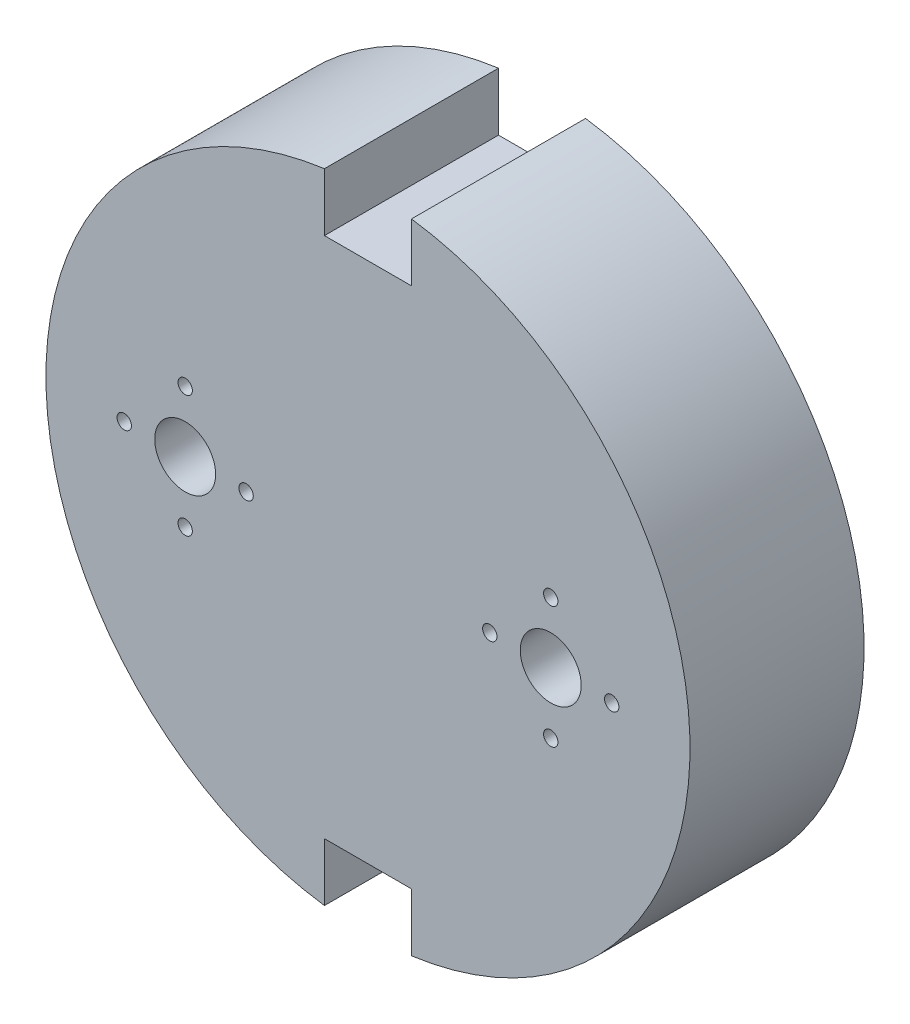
ISO-10303-21;
HEADER;
FILE_DESCRIPTION(('STEP AP214'),'2;1');
FILE_NAME('part.step','',(''),(''),'','','');
FILE_SCHEMA(('AUTOMOTIVE_DESIGN { 1 0 10303 214 1 1 1 1 }'));
ENDSEC;
DATA;
#1=APPLICATION_CONTEXT('core data for automotive mechanical design processes');
#2=APPLICATION_PROTOCOL_DEFINITION('international standard','automotive_design',2000,#1);
#3=PRODUCT_CONTEXT('',#1,'mechanical');
#4=PRODUCT('Part','Part','',(#3));
#5=PRODUCT_RELATED_PRODUCT_CATEGORY('part','',(#4));
#6=PRODUCT_DEFINITION_FORMATION('','',#4);
#7=PRODUCT_DEFINITION_CONTEXT('part definition',#1,'design');
#8=PRODUCT_DEFINITION('design','',#6,#7);
#9=PRODUCT_DEFINITION_SHAPE('','',#8);
#10=(LENGTH_UNIT() NAMED_UNIT(*) SI_UNIT(.MILLI.,.METRE.));
#11=(NAMED_UNIT(*) PLANE_ANGLE_UNIT() SI_UNIT($,.RADIAN.));
#12=(NAMED_UNIT(*) SI_UNIT($,.STERADIAN.) SOLID_ANGLE_UNIT());
#13=UNCERTAINTY_MEASURE_WITH_UNIT(LENGTH_MEASURE(1.E-05),#10,'distance_accuracy_value','');
#14=(GEOMETRIC_REPRESENTATION_CONTEXT(3) GLOBAL_UNCERTAINTY_ASSIGNED_CONTEXT((#13)) GLOBAL_UNIT_ASSIGNED_CONTEXT((#10,
#11,#12)) REPRESENTATION_CONTEXT('',''));
#15=CARTESIAN_POINT('',(0.,0.,0.));
#16=DIRECTION('',(0.,0.,1.));
#17=DIRECTION('',(1.,0.,0.));
#18=AXIS2_PLACEMENT_3D('',#15,#16,#17);
#19=CARTESIAN_POINT('',(0.,0.,0.));
#20=DIRECTION('',(0.,0.,1.));
#21=DIRECTION('',(1.,0.,0.));
#22=AXIS2_PLACEMENT_3D('',#19,#20,#21);
#23=PLANE('',#22);
#24=CARTESIAN_POINT('',(-42.,14.,0.));
#25=DIRECTION('',(0.,0.,1.));
#26=DIRECTION('',(1.,0.,0.));
#27=AXIS2_PLACEMENT_3D('',#24,#25,#26);
#28=CIRCLE('',#27,1.64999999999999);
#29=CARTESIAN_POINT('',(-40.35,14.,0.));
#30=VERTEX_POINT('',#29);
#31=EDGE_CURVE('E290',#30,#30,#28,.T.);
#32=ORIENTED_EDGE('',*,*,#31,.T.);
#33=EDGE_LOOP('',(#32));
#34=FACE_BOUND('',#33,.T.);
#35=CARTESIAN_POINT('',(-42.,-14.,0.));
#36=DIRECTION('',(0.,0.,1.));
#37=DIRECTION('',(1.,0.,0.));
#38=AXIS2_PLACEMENT_3D('',#35,#36,#37);
#39=CIRCLE('',#38,1.64999999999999);
#40=CARTESIAN_POINT('',(-40.35,-14.,0.));
#41=VERTEX_POINT('',#40);
#42=EDGE_CURVE('E284',#41,#41,#39,.T.);
#43=ORIENTED_EDGE('',*,*,#42,.T.);
#44=EDGE_LOOP('',(#43));
#45=FACE_BOUND('',#44,.T.);
#46=CARTESIAN_POINT('',(-28.,0.,0.));
#47=DIRECTION('',(0.,0.,1.));
#48=DIRECTION('',(1.,0.,0.));
#49=AXIS2_PLACEMENT_3D('',#46,#47,#48);
#50=CIRCLE('',#49,1.64999999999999);
#51=CARTESIAN_POINT('',(-26.35,0.,0.));
#52=VERTEX_POINT('',#51);
#53=EDGE_CURVE('E278',#52,#52,#50,.T.);
#54=ORIENTED_EDGE('',*,*,#53,.T.);
#55=EDGE_LOOP('',(#54));
#56=FACE_BOUND('',#55,.T.);
#57=CARTESIAN_POINT('',(28.,0.,0.));
#58=DIRECTION('',(0.,0.,1.));
#59=DIRECTION('',(1.,0.,0.));
#60=AXIS2_PLACEMENT_3D('',#57,#58,#59);
#61=CIRCLE('',#60,1.64999999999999);
#62=CARTESIAN_POINT('',(29.65,0.,0.));
#63=VERTEX_POINT('',#62);
#64=EDGE_CURVE('E272',#63,#63,#61,.T.);
#65=ORIENTED_EDGE('',*,*,#64,.T.);
#66=EDGE_LOOP('',(#65));
#67=FACE_BOUND('',#66,.T.);
#68=CARTESIAN_POINT('',(42.,14.,0.));
#69=DIRECTION('',(0.,0.,1.));
#70=DIRECTION('',(1.,0.,0.));
#71=AXIS2_PLACEMENT_3D('',#68,#69,#70);
#72=CIRCLE('',#71,1.64999999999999);
#73=CARTESIAN_POINT('',(43.65,14.,0.));
#74=VERTEX_POINT('',#73);
#75=EDGE_CURVE('E266',#74,#74,#72,.T.);
#76=ORIENTED_EDGE('',*,*,#75,.T.);
#77=EDGE_LOOP('',(#76));
#78=FACE_BOUND('',#77,.T.);
#79=CARTESIAN_POINT('',(56.,0.,0.));
#80=DIRECTION('',(0.,0.,1.));
#81=DIRECTION('',(1.,0.,0.));
#82=AXIS2_PLACEMENT_3D('',#79,#80,#81);
#83=CIRCLE('',#82,1.64999999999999);
#84=CARTESIAN_POINT('',(57.65,0.,0.));
#85=VERTEX_POINT('',#84);
#86=EDGE_CURVE('E260',#85,#85,#83,.T.);
#87=ORIENTED_EDGE('',*,*,#86,.T.);
#88=EDGE_LOOP('',(#87));
#89=FACE_BOUND('',#88,.T.);
#90=CARTESIAN_POINT('',(42.,-14.,0.));
#91=DIRECTION('',(0.,0.,1.));
#92=DIRECTION('',(1.,0.,0.));
#93=AXIS2_PLACEMENT_3D('',#90,#91,#92);
#94=CIRCLE('',#93,1.64999999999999);
#95=CARTESIAN_POINT('',(43.65,-14.,0.));
#96=VERTEX_POINT('',#95);
#97=EDGE_CURVE('E254',#96,#96,#94,.T.);
#98=ORIENTED_EDGE('',*,*,#97,.T.);
#99=EDGE_LOOP('',(#98));
#100=FACE_BOUND('',#99,.T.);
#101=CARTESIAN_POINT('',(-56.,0.,0.));
#102=DIRECTION('',(0.,0.,1.));
#103=DIRECTION('',(1.,0.,0.));
#104=AXIS2_PLACEMENT_3D('',#101,#102,#103);
#105=CIRCLE('',#104,1.64999999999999);
#106=CARTESIAN_POINT('',(-54.35,0.,0.));
#107=VERTEX_POINT('',#106);
#108=EDGE_CURVE('E246',#107,#107,#105,.T.);
#109=ORIENTED_EDGE('',*,*,#108,.T.);
#110=EDGE_LOOP('',(#109));
#111=FACE_BOUND('',#110,.T.);
#112=CARTESIAN_POINT('',(42.,0.,0.));
#113=DIRECTION('',(0.,0.,1.));
#114=DIRECTION('',(1.,0.,0.));
#115=AXIS2_PLACEMENT_3D('',#112,#113,#114);
#116=CIRCLE('',#115,7.);
#117=CARTESIAN_POINT('',(49.,0.,0.));
#118=VERTEX_POINT('',#117);
#119=EDGE_CURVE('E243',#118,#118,#116,.T.);
#120=ORIENTED_EDGE('',*,*,#119,.T.);
#121=EDGE_LOOP('',(#120));
#122=FACE_BOUND('',#121,.T.);
#123=CARTESIAN_POINT('',(0.,0.,0.));
#124=DIRECTION('',(0.,0.,1.));
#125=DIRECTION('',(1.,0.,0.));
#126=AXIS2_PLACEMENT_3D('',#123,#124,#125);
#127=CIRCLE('',#126,74.);
#128=CARTESIAN_POINT('',(10.,-73.3212111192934,0.));
#129=VERTEX_POINT('',#128);
#130=CARTESIAN_POINT('',(9.99999999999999,73.3212111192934,0.));
#131=VERTEX_POINT('',#130);
#132=EDGE_CURVE('E131',#129,#131,#127,.T.);
#133=ORIENTED_EDGE('',*,*,#132,.F.);
#134=DIRECTION('',(0.,-1.,0.));
#135=VECTOR('',#134,1.);
#136=CARTESIAN_POINT('',(10.,-60.,0.));
#137=LINE('',#136,#135);
#138=CARTESIAN_POINT('',(10.,-60.,0.));
#139=VERTEX_POINT('',#138);
#140=EDGE_CURVE('E84',#139,#129,#137,.T.);
#141=ORIENTED_EDGE('',*,*,#140,.F.);
#142=DIRECTION('',(1.,0.,0.));
#143=VECTOR('',#142,1.);
#144=CARTESIAN_POINT('',(-9.99999999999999,-60.,0.));
#145=LINE('',#144,#143);
#146=CARTESIAN_POINT('',(-9.99999999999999,-60.,0.));
#147=VERTEX_POINT('',#146);
#148=EDGE_CURVE('E78',#147,#139,#145,.T.);
#149=ORIENTED_EDGE('',*,*,#148,.F.);
#150=DIRECTION('',(0.,1.,0.));
#151=VECTOR('',#150,1.);
#152=CARTESIAN_POINT('',(-9.99999999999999,-60.,0.));
#153=LINE('',#152,#151);
#154=CARTESIAN_POINT('',(-10.,-73.3212111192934,0.));
#155=VERTEX_POINT('',#154);
#156=EDGE_CURVE('E121',#155,#147,#153,.T.);
#157=ORIENTED_EDGE('',*,*,#156,.F.);
#158=CARTESIAN_POINT('',(0.,0.,0.));
#159=DIRECTION('',(0.,0.,1.));
#160=DIRECTION('',(1.,0.,0.));
#161=AXIS2_PLACEMENT_3D('',#158,#159,#160);
#162=CIRCLE('',#161,74.);
#163=CARTESIAN_POINT('',(-10.,73.3212111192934,0.));
#164=VERTEX_POINT('',#163);
#165=EDGE_CURVE('E141',#164,#155,#162,.T.);
#166=ORIENTED_EDGE('',*,*,#165,.F.);
#167=DIRECTION('',(0.,1.,0.));
#168=VECTOR('',#167,1.);
#169=CARTESIAN_POINT('',(-10.,73.3212111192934,0.));
#170=LINE('',#169,#168);
#171=CARTESIAN_POINT('',(-10.,60.,0.));
#172=VERTEX_POINT('',#171);
#173=EDGE_CURVE('E139',#172,#164,#170,.T.);
#174=ORIENTED_EDGE('',*,*,#173,.F.);
#175=DIRECTION('',(-1.,0.,0.));
#176=VECTOR('',#175,1.);
#177=CARTESIAN_POINT('',(-10.,60.,0.));
#178=LINE('',#177,#176);
#179=CARTESIAN_POINT('',(9.99999999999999,60.,0.));
#180=VERTEX_POINT('',#179);
#181=EDGE_CURVE('E137',#180,#172,#178,.T.);
#182=ORIENTED_EDGE('',*,*,#181,.F.);
#183=DIRECTION('',(0.,-1.,0.));
#184=VECTOR('',#183,1.);
#185=CARTESIAN_POINT('',(9.99999999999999,73.3212111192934,0.));
#186=LINE('',#185,#184);
#187=EDGE_CURVE('E134',#131,#180,#186,.T.);
#188=ORIENTED_EDGE('',*,*,#187,.F.);
#189=EDGE_LOOP('',(#133,#141,#149,#157,#166,#174,#182,#188));
#190=FACE_BOUND('',#189,.T.);
#191=CARTESIAN_POINT('',(-42.,0.,0.));
#192=DIRECTION('',(0.,0.,1.));
#193=DIRECTION('',(1.,0.,0.));
#194=AXIS2_PLACEMENT_3D('',#191,#192,#193);
#195=CIRCLE('',#194,7.);
#196=CARTESIAN_POINT('',(-35.,0.,0.));
#197=VERTEX_POINT('',#196);
#198=EDGE_CURVE('E237',#197,#197,#195,.T.);
#199=ORIENTED_EDGE('',*,*,#198,.T.);
#200=EDGE_LOOP('',(#199));
#201=FACE_BOUND('',#200,.T.);
#202=CARTESIAN_POINT('',(0.,0.,0.));
#203=DIRECTION('',(0.,0.,1.));
#204=DIRECTION('',(1.,0.,0.));
#205=AXIS2_PLACEMENT_3D('',#202,#203,#204);
#206=CIRCLE('',#205,15.);
#207=CARTESIAN_POINT('',(15.,0.,0.));
#208=VERTEX_POINT('',#207);
#209=EDGE_CURVE('E161',#208,#208,#206,.F.);
#210=ORIENTED_EDGE('',*,*,#209,.F.);
#211=EDGE_LOOP('',(#210));
#212=FACE_BOUND('',#211,.T.);
#213=ADVANCED_FACE('F32',(#34,#45,#56,#67,#78,#89,#100,#111,#122,#190,#201,#212),#23,.F.);
#214=CARTESIAN_POINT('',(0.,0.,40.));
#215=DIRECTION('',(0.,0.,1.));
#216=DIRECTION('',(1.,0.,0.));
#217=AXIS2_PLACEMENT_3D('',#214,#215,#216);
#218=PLANE('',#217);
#219=CARTESIAN_POINT('',(-42.,14.,40.));
#220=DIRECTION('',(0.,0.,1.));
#221=DIRECTION('',(1.,0.,0.));
#222=AXIS2_PLACEMENT_3D('',#219,#220,#221);
#223=CIRCLE('',#222,1.65);
#224=CARTESIAN_POINT('',(-40.35,14.,40.));
#225=VERTEX_POINT('',#224);
#226=EDGE_CURVE('E292',#225,#225,#223,.T.);
#227=ORIENTED_EDGE('',*,*,#226,.F.);
#228=EDGE_LOOP('',(#227));
#229=FACE_BOUND('',#228,.T.);
#230=CARTESIAN_POINT('',(-42.,-14.,40.));
#231=DIRECTION('',(0.,0.,1.));
#232=DIRECTION('',(1.,0.,0.));
#233=AXIS2_PLACEMENT_3D('',#230,#231,#232);
#234=CIRCLE('',#233,1.65);
#235=CARTESIAN_POINT('',(-40.35,-14.,40.));
#236=VERTEX_POINT('',#235);
#237=EDGE_CURVE('E287',#236,#236,#234,.T.);
#238=ORIENTED_EDGE('',*,*,#237,.F.);
#239=EDGE_LOOP('',(#238));
#240=FACE_BOUND('',#239,.T.);
#241=CARTESIAN_POINT('',(-28.,0.,40.));
#242=DIRECTION('',(0.,0.,1.));
#243=DIRECTION('',(1.,0.,0.));
#244=AXIS2_PLACEMENT_3D('',#241,#242,#243);
#245=CIRCLE('',#244,1.65);
#246=CARTESIAN_POINT('',(-26.35,0.,40.));
#247=VERTEX_POINT('',#246);
#248=EDGE_CURVE('E281',#247,#247,#245,.T.);
#249=ORIENTED_EDGE('',*,*,#248,.F.);
#250=EDGE_LOOP('',(#249));
#251=FACE_BOUND('',#250,.T.);
#252=CARTESIAN_POINT('',(28.,0.,40.));
#253=DIRECTION('',(0.,0.,1.));
#254=DIRECTION('',(1.,0.,0.));
#255=AXIS2_PLACEMENT_3D('',#252,#253,#254);
#256=CIRCLE('',#255,1.65);
#257=CARTESIAN_POINT('',(29.65,0.,40.));
#258=VERTEX_POINT('',#257);
#259=EDGE_CURVE('E275',#258,#258,#256,.T.);
#260=ORIENTED_EDGE('',*,*,#259,.F.);
#261=EDGE_LOOP('',(#260));
#262=FACE_BOUND('',#261,.T.);
#263=CARTESIAN_POINT('',(42.,14.,40.));
#264=DIRECTION('',(0.,0.,1.));
#265=DIRECTION('',(1.,0.,0.));
#266=AXIS2_PLACEMENT_3D('',#263,#264,#265);
#267=CIRCLE('',#266,1.65);
#268=CARTESIAN_POINT('',(43.65,14.,40.));
#269=VERTEX_POINT('',#268);
#270=EDGE_CURVE('E269',#269,#269,#267,.T.);
#271=ORIENTED_EDGE('',*,*,#270,.F.);
#272=EDGE_LOOP('',(#271));
#273=FACE_BOUND('',#272,.T.);
#274=CARTESIAN_POINT('',(56.,0.,40.));
#275=DIRECTION('',(0.,0.,1.));
#276=DIRECTION('',(1.,0.,0.));
#277=AXIS2_PLACEMENT_3D('',#274,#275,#276);
#278=CIRCLE('',#277,1.65);
#279=CARTESIAN_POINT('',(57.65,0.,40.));
#280=VERTEX_POINT('',#279);
#281=EDGE_CURVE('E263',#280,#280,#278,.T.);
#282=ORIENTED_EDGE('',*,*,#281,.F.);
#283=EDGE_LOOP('',(#282));
#284=FACE_BOUND('',#283,.T.);
#285=CARTESIAN_POINT('',(42.,-14.,40.));
#286=DIRECTION('',(0.,0.,1.));
#287=DIRECTION('',(1.,0.,0.));
#288=AXIS2_PLACEMENT_3D('',#285,#286,#287);
#289=CIRCLE('',#288,1.65);
#290=CARTESIAN_POINT('',(43.65,-14.,40.));
#291=VERTEX_POINT('',#290);
#292=EDGE_CURVE('E257',#291,#291,#289,.T.);
#293=ORIENTED_EDGE('',*,*,#292,.F.);
#294=EDGE_LOOP('',(#293));
#295=FACE_BOUND('',#294,.T.);
#296=CARTESIAN_POINT('',(-56.,0.,40.));
#297=DIRECTION('',(0.,0.,1.));
#298=DIRECTION('',(1.,0.,0.));
#299=AXIS2_PLACEMENT_3D('',#296,#297,#298);
#300=CIRCLE('',#299,1.65);
#301=CARTESIAN_POINT('',(-54.35,0.,40.));
#302=VERTEX_POINT('',#301);
#303=EDGE_CURVE('E251',#302,#302,#300,.T.);
#304=ORIENTED_EDGE('',*,*,#303,.F.);
#305=EDGE_LOOP('',(#304));
#306=FACE_BOUND('',#305,.T.);
#307=CARTESIAN_POINT('',(-42.,0.,40.));
#308=DIRECTION('',(0.,0.,1.));
#309=DIRECTION('',(1.,0.,0.));
#310=AXIS2_PLACEMENT_3D('',#307,#308,#309);
#311=CIRCLE('',#310,7.);
#312=CARTESIAN_POINT('',(-35.,0.,40.));
#313=VERTEX_POINT('',#312);
#314=EDGE_CURVE('E135',#313,#313,#311,.T.);
#315=ORIENTED_EDGE('',*,*,#314,.F.);
#316=EDGE_LOOP('',(#315));
#317=FACE_BOUND('',#316,.T.);
#318=CARTESIAN_POINT('',(0.,0.,40.));
#319=DIRECTION('',(0.,0.,1.));
#320=DIRECTION('',(1.,0.,0.));
#321=AXIS2_PLACEMENT_3D('',#318,#319,#320);
#322=CIRCLE('',#321,74.);
#323=CARTESIAN_POINT('',(10.,-73.3212111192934,40.));
#324=VERTEX_POINT('',#323);
#325=CARTESIAN_POINT('',(9.99999999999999,73.3212111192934,40.));
#326=VERTEX_POINT('',#325);
#327=EDGE_CURVE('E146',#324,#326,#322,.T.);
#328=ORIENTED_EDGE('',*,*,#327,.T.);
#329=DIRECTION('',(0.,-1.,0.));
#330=VECTOR('',#329,1.);
#331=CARTESIAN_POINT('',(9.99999999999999,73.3212111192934,40.));
#332=LINE('',#331,#330);
#333=CARTESIAN_POINT('',(9.99999999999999,60.,40.));
#334=VERTEX_POINT('',#333);
#335=EDGE_CURVE('E93',#326,#334,#332,.T.);
#336=ORIENTED_EDGE('',*,*,#335,.T.);
#337=DIRECTION('',(-1.,0.,0.));
#338=VECTOR('',#337,1.);
#339=CARTESIAN_POINT('',(-10.,60.,40.));
#340=LINE('',#339,#338);
#341=CARTESIAN_POINT('',(-10.,60.,40.));
#342=VERTEX_POINT('',#341);
#343=EDGE_CURVE('E229',#334,#342,#340,.T.);
#344=ORIENTED_EDGE('',*,*,#343,.T.);
#345=DIRECTION('',(0.,1.,0.));
#346=VECTOR('',#345,1.);
#347=CARTESIAN_POINT('',(-10.,73.3212111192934,40.));
#348=LINE('',#347,#346);
#349=CARTESIAN_POINT('',(-10.,73.3212111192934,40.));
#350=VERTEX_POINT('',#349);
#351=EDGE_CURVE('E231',#342,#350,#348,.T.);
#352=ORIENTED_EDGE('',*,*,#351,.T.);
#353=CARTESIAN_POINT('',(0.,0.,40.));
#354=DIRECTION('',(0.,0.,1.));
#355=DIRECTION('',(1.,0.,0.));
#356=AXIS2_PLACEMENT_3D('',#353,#354,#355);
#357=CIRCLE('',#356,74.);
#358=CARTESIAN_POINT('',(-10.,-73.3212111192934,40.));
#359=VERTEX_POINT('',#358);
#360=EDGE_CURVE('E113',#350,#359,#357,.T.);
#361=ORIENTED_EDGE('',*,*,#360,.T.);
#362=DIRECTION('',(0.,1.,0.));
#363=VECTOR('',#362,1.);
#364=CARTESIAN_POINT('',(-9.99999999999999,-60.,40.));
#365=LINE('',#364,#363);
#366=CARTESIAN_POINT('',(-9.99999999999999,-60.,40.));
#367=VERTEX_POINT('',#366);
#368=EDGE_CURVE('E106',#359,#367,#365,.T.);
#369=ORIENTED_EDGE('',*,*,#368,.T.);
#370=DIRECTION('',(1.,0.,0.));
#371=VECTOR('',#370,1.);
#372=CARTESIAN_POINT('',(-9.99999999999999,-60.,40.));
#373=LINE('',#372,#371);
#374=CARTESIAN_POINT('',(10.,-60.,40.));
#375=VERTEX_POINT('',#374);
#376=EDGE_CURVE('E111',#367,#375,#373,.T.);
#377=ORIENTED_EDGE('',*,*,#376,.T.);
#378=DIRECTION('',(0.,-1.,0.));
#379=VECTOR('',#378,1.);
#380=CARTESIAN_POINT('',(10.,-60.,40.));
#381=LINE('',#380,#379);
#382=EDGE_CURVE('E49',#375,#324,#381,.T.);
#383=ORIENTED_EDGE('',*,*,#382,.T.);
#384=EDGE_LOOP('',(#328,#336,#344,#352,#361,#369,#377,#383));
#385=FACE_BOUND('',#384,.T.);
#386=CARTESIAN_POINT('',(42.,0.,40.));
#387=DIRECTION('',(0.,0.,1.));
#388=DIRECTION('',(1.,0.,0.));
#389=AXIS2_PLACEMENT_3D('',#386,#387,#388);
#390=CIRCLE('',#389,7.);
#391=CARTESIAN_POINT('',(49.,0.,40.));
#392=VERTEX_POINT('',#391);
#393=EDGE_CURVE('E240',#392,#392,#390,.T.);
#394=ORIENTED_EDGE('',*,*,#393,.F.);
#395=EDGE_LOOP('',(#394));
#396=FACE_BOUND('',#395,.T.);
#397=ADVANCED_FACE('F108',(#229,#240,#251,#262,#273,#284,#295,#306,#317,#385,#396),#218,.T.);
#398=CARTESIAN_POINT('',(0.,0.,40.));
#399=DIRECTION('',(0.,0.,-1.));
#400=DIRECTION('',(-1.,0.,0.));
#401=AXIS2_PLACEMENT_3D('',#398,#399,#400);
#402=CYLINDRICAL_SURFACE('',#401,74.);
#403=ORIENTED_EDGE('',*,*,#132,.T.);
#404=DIRECTION('',(0.,0.,-1.));
#405=VECTOR('',#404,1.);
#406=CARTESIAN_POINT('',(9.99999999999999,73.3212111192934,40.));
#407=LINE('',#406,#405);
#408=EDGE_CURVE('E159',#326,#131,#407,.T.);
#409=ORIENTED_EDGE('',*,*,#408,.F.);
#410=ORIENTED_EDGE('',*,*,#327,.F.);
#411=DIRECTION('',(0.,0.,-1.));
#412=VECTOR('',#411,1.);
#413=CARTESIAN_POINT('',(10.,-73.3212111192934,40.));
#414=LINE('',#413,#412);
#415=EDGE_CURVE('E127',#324,#129,#414,.T.);
#416=ORIENTED_EDGE('',*,*,#415,.T.);
#417=EDGE_LOOP('',(#403,#409,#410,#416));
#418=FACE_BOUND('',#417,.T.);
#419=ADVANCED_FACE('F187',(#418),#402,.T.);
#420=CARTESIAN_POINT('',(9.99999999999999,73.3212111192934,40.));
#421=DIRECTION('',(1.,0.,0.));
#422=DIRECTION('',(0.,1.,0.));
#423=AXIS2_PLACEMENT_3D('',#420,#421,#422);
#424=PLANE('',#423);
#425=ORIENTED_EDGE('',*,*,#187,.T.);
#426=DIRECTION('',(0.,0.,-1.));
#427=VECTOR('',#426,1.);
#428=CARTESIAN_POINT('',(9.99999999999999,60.,40.));
#429=LINE('',#428,#427);
#430=EDGE_CURVE('E156',#334,#180,#429,.T.);
#431=ORIENTED_EDGE('',*,*,#430,.F.);
#432=ORIENTED_EDGE('',*,*,#335,.F.);
#433=ORIENTED_EDGE('',*,*,#408,.T.);
#434=EDGE_LOOP('',(#425,#431,#432,#433));
#435=FACE_BOUND('',#434,.T.);
#436=ADVANCED_FACE('F213',(#435),#424,.F.);
#437=CARTESIAN_POINT('',(-10.,60.,40.));
#438=DIRECTION('',(0.,-1.,0.));
#439=DIRECTION('',(0.,0.,-1.));
#440=AXIS2_PLACEMENT_3D('',#437,#438,#439);
#441=PLANE('',#440);
#442=ORIENTED_EDGE('',*,*,#181,.T.);
#443=DIRECTION('',(0.,0.,-1.));
#444=VECTOR('',#443,1.);
#445=CARTESIAN_POINT('',(-10.,60.,40.));
#446=LINE('',#445,#444);
#447=EDGE_CURVE('E153',#342,#172,#446,.T.);
#448=ORIENTED_EDGE('',*,*,#447,.F.);
#449=ORIENTED_EDGE('',*,*,#343,.F.);
#450=ORIENTED_EDGE('',*,*,#430,.T.);
#451=EDGE_LOOP('',(#442,#448,#449,#450));
#452=FACE_BOUND('',#451,.T.);
#453=ADVANCED_FACE('F209',(#452),#441,.F.);
#454=CARTESIAN_POINT('',(-10.,73.3212111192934,40.));
#455=DIRECTION('',(-1.,0.,0.));
#456=DIRECTION('',(0.,-1.,0.));
#457=AXIS2_PLACEMENT_3D('',#454,#455,#456);
#458=PLANE('',#457);
#459=ORIENTED_EDGE('',*,*,#173,.T.);
#460=DIRECTION('',(0.,0.,-1.));
#461=VECTOR('',#460,1.);
#462=CARTESIAN_POINT('',(-10.,73.3212111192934,40.));
#463=LINE('',#462,#461);
#464=EDGE_CURVE('E150',#350,#164,#463,.T.);
#465=ORIENTED_EDGE('',*,*,#464,.F.);
#466=ORIENTED_EDGE('',*,*,#351,.F.);
#467=ORIENTED_EDGE('',*,*,#447,.T.);
#468=EDGE_LOOP('',(#459,#465,#466,#467));
#469=FACE_BOUND('',#468,.T.);
#470=ADVANCED_FACE('F205',(#469),#458,.F.);
#471=CARTESIAN_POINT('',(0.,0.,40.));
#472=DIRECTION('',(0.,0.,-1.));
#473=DIRECTION('',(-1.,0.,0.));
#474=AXIS2_PLACEMENT_3D('',#471,#472,#473);
#475=CYLINDRICAL_SURFACE('',#474,74.);
#476=ORIENTED_EDGE('',*,*,#165,.T.);
#477=DIRECTION('',(0.,0.,-1.));
#478=VECTOR('',#477,1.);
#479=CARTESIAN_POINT('',(-10.,-73.3212111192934,40.));
#480=LINE('',#479,#478);
#481=EDGE_CURVE('E122',#359,#155,#480,.T.);
#482=ORIENTED_EDGE('',*,*,#481,.F.);
#483=ORIENTED_EDGE('',*,*,#360,.F.);
#484=ORIENTED_EDGE('',*,*,#464,.T.);
#485=EDGE_LOOP('',(#476,#482,#483,#484));
#486=FACE_BOUND('',#485,.T.);
#487=ADVANCED_FACE('F202',(#486),#475,.T.);
#488=CARTESIAN_POINT('',(-9.99999999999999,-60.,40.));
#489=DIRECTION('',(-1.,0.,0.));
#490=DIRECTION('',(0.,-1.,0.));
#491=AXIS2_PLACEMENT_3D('',#488,#489,#490);
#492=PLANE('',#491);
#493=ORIENTED_EDGE('',*,*,#156,.T.);
#494=DIRECTION('',(0.,0.,-1.));
#495=VECTOR('',#494,1.);
#496=CARTESIAN_POINT('',(-9.99999999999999,-60.,40.));
#497=LINE('',#496,#495);
#498=EDGE_CURVE('E118',#367,#147,#497,.T.);
#499=ORIENTED_EDGE('',*,*,#498,.F.);
#500=ORIENTED_EDGE('',*,*,#368,.F.);
#501=ORIENTED_EDGE('',*,*,#481,.T.);
#502=EDGE_LOOP('',(#493,#499,#500,#501));
#503=FACE_BOUND('',#502,.T.);
#504=ADVANCED_FACE('F119',(#503),#492,.F.);
#505=CARTESIAN_POINT('',(-9.99999999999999,-60.,40.));
#506=DIRECTION('',(0.,1.,0.));
#507=DIRECTION('',(0.,0.,1.));
#508=AXIS2_PLACEMENT_3D('',#505,#506,#507);
#509=PLANE('',#508);
#510=ORIENTED_EDGE('',*,*,#148,.T.);
#511=DIRECTION('',(0.,0.,-1.));
#512=VECTOR('',#511,1.);
#513=CARTESIAN_POINT('',(10.,-60.,40.));
#514=LINE('',#513,#512);
#515=EDGE_CURVE('E123',#375,#139,#514,.T.);
#516=ORIENTED_EDGE('',*,*,#515,.F.);
#517=ORIENTED_EDGE('',*,*,#376,.F.);
#518=ORIENTED_EDGE('',*,*,#498,.T.);
#519=EDGE_LOOP('',(#510,#516,#517,#518));
#520=FACE_BOUND('',#519,.T.);
#521=ADVANCED_FACE('F125',(#520),#509,.F.);
#522=CARTESIAN_POINT('',(10.,-60.,40.));
#523=DIRECTION('',(1.,0.,0.));
#524=DIRECTION('',(0.,1.,0.));
#525=AXIS2_PLACEMENT_3D('',#522,#523,#524);
#526=PLANE('',#525);
#527=ORIENTED_EDGE('',*,*,#140,.T.);
#528=ORIENTED_EDGE('',*,*,#415,.F.);
#529=ORIENTED_EDGE('',*,*,#382,.F.);
#530=ORIENTED_EDGE('',*,*,#515,.T.);
#531=EDGE_LOOP('',(#527,#528,#529,#530));
#532=FACE_BOUND('',#531,.T.);
#533=ADVANCED_FACE('F194',(#532),#526,.F.);
#534=CARTESIAN_POINT('',(-42.,0.,40.));
#535=DIRECTION('',(0.,0.,-1.));
#536=DIRECTION('',(-1.,0.,0.));
#537=AXIS2_PLACEMENT_3D('',#534,#535,#536);
#538=CYLINDRICAL_SURFACE('',#537,7.);
#539=ORIENTED_EDGE('',*,*,#314,.T.);
#540=EDGE_LOOP('',(#539));
#541=FACE_BOUND('',#540,.T.);
#542=ORIENTED_EDGE('',*,*,#198,.F.);
#543=EDGE_LOOP('',(#542));
#544=FACE_BOUND('',#543,.T.);
#545=ADVANCED_FACE('F197',(#541,#544),#538,.F.);
#546=CARTESIAN_POINT('',(42.,0.,40.));
#547=DIRECTION('',(0.,0.,-1.));
#548=DIRECTION('',(-1.,0.,0.));
#549=AXIS2_PLACEMENT_3D('',#546,#547,#548);
#550=CYLINDRICAL_SURFACE('',#549,7.);
#551=ORIENTED_EDGE('',*,*,#393,.T.);
#552=EDGE_LOOP('',(#551));
#553=FACE_BOUND('',#552,.T.);
#554=ORIENTED_EDGE('',*,*,#119,.F.);
#555=EDGE_LOOP('',(#554));
#556=FACE_BOUND('',#555,.T.);
#557=ADVANCED_FACE('F317',(#553,#556),#550,.F.);
#558=CARTESIAN_POINT('',(0.,0.,-12.));
#559=DIRECTION('',(0.,0.,1.));
#560=DIRECTION('',(1.,0.,0.));
#561=AXIS2_PLACEMENT_3D('',#558,#559,#560);
#562=CYLINDRICAL_SURFACE('',#561,15.);
#563=CARTESIAN_POINT('',(0.,0.,-9.99999999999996));
#564=DIRECTION('',(0.,0.,-1.));
#565=DIRECTION('',(-1.,0.,0.));
#566=AXIS2_PLACEMENT_3D('',#563,#564,#565);
#567=CIRCLE('',#566,15.);
#568=CARTESIAN_POINT('',(-15.,0.,-9.99999999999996));
#569=VERTEX_POINT('',#568);
#570=EDGE_CURVE('E11',#569,#569,#567,.F.);
#571=ORIENTED_EDGE('',*,*,#570,.T.);
#572=EDGE_LOOP('',(#571));
#573=FACE_BOUND('',#572,.T.);
#574=ORIENTED_EDGE('',*,*,#209,.T.);
#575=EDGE_LOOP('',(#574));
#576=FACE_BOUND('',#575,.T.);
#577=ADVANCED_FACE('F178',(#573,#576),#562,.T.);
#578=CARTESIAN_POINT('',(0.,0.,-12.));
#579=DIRECTION('',(0.,0.,-1.));
#580=DIRECTION('',(-1.,0.,0.));
#581=AXIS2_PLACEMENT_3D('',#578,#579,#580);
#582=PLANE('',#581);
#583=CARTESIAN_POINT('',(0.,0.,-12.));
#584=DIRECTION('',(0.,0.,-1.));
#585=DIRECTION('',(-1.,0.,0.));
#586=AXIS2_PLACEMENT_3D('',#583,#584,#585);
#587=CIRCLE('',#586,13.);
#588=CARTESIAN_POINT('',(-13.,0.,-12.));
#589=VERTEX_POINT('',#588);
#590=EDGE_CURVE('E41',#589,#589,#587,.T.);
#591=ORIENTED_EDGE('',*,*,#590,.T.);
#592=EDGE_LOOP('',(#591));
#593=FACE_BOUND('',#592,.T.);
#594=ADVANCED_FACE('F166',(#593),#582,.T.);
#595=CARTESIAN_POINT('',(0.,0.,-12.));
#596=DIRECTION('',(0.,0.,1.));
#597=DIRECTION('',(1.,0.,0.));
#598=AXIS2_PLACEMENT_3D('',#595,#596,#597);
#599=CONICAL_SURFACE('',#598,13.,0.78539816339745);
#600=ORIENTED_EDGE('',*,*,#570,.F.);
#601=EDGE_LOOP('',(#600));
#602=FACE_BOUND('',#601,.T.);
#603=ORIENTED_EDGE('',*,*,#590,.F.);
#604=EDGE_LOOP('',(#603));
#605=FACE_BOUND('',#604,.T.);
#606=ADVANCED_FACE('F34',(#602,#605),#599,.T.);
#607=CARTESIAN_POINT('',(-56.,0.,40.));
#608=DIRECTION('',(0.,0.,1.));
#609=DIRECTION('',(1.,0.,0.));
#610=AXIS2_PLACEMENT_3D('',#607,#608,#609);
#611=CYLINDRICAL_SURFACE('',#610,1.64999999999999);
#612=ORIENTED_EDGE('',*,*,#303,.T.);
#613=EDGE_LOOP('',(#612));
#614=FACE_BOUND('',#613,.T.);
#615=ORIENTED_EDGE('',*,*,#108,.F.);
#616=EDGE_LOOP('',(#615));
#617=FACE_BOUND('',#616,.T.);
#618=ADVANCED_FACE('F169',(#614,#617),#611,.F.);
#619=CARTESIAN_POINT('',(42.,-14.,40.));
#620=DIRECTION('',(0.,0.,1.));
#621=DIRECTION('',(1.,0.,0.));
#622=AXIS2_PLACEMENT_3D('',#619,#620,#621);
#623=CYLINDRICAL_SURFACE('',#622,1.64999999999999);
#624=ORIENTED_EDGE('',*,*,#292,.T.);
#625=EDGE_LOOP('',(#624));
#626=FACE_BOUND('',#625,.T.);
#627=ORIENTED_EDGE('',*,*,#97,.F.);
#628=EDGE_LOOP('',(#627));
#629=FACE_BOUND('',#628,.T.);
#630=ADVANCED_FACE('F175',(#626,#629),#623,.F.);
#631=CARTESIAN_POINT('',(56.,0.,40.));
#632=DIRECTION('',(0.,0.,1.));
#633=DIRECTION('',(1.,0.,0.));
#634=AXIS2_PLACEMENT_3D('',#631,#632,#633);
#635=CYLINDRICAL_SURFACE('',#634,1.64999999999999);
#636=ORIENTED_EDGE('',*,*,#281,.T.);
#637=EDGE_LOOP('',(#636));
#638=FACE_BOUND('',#637,.T.);
#639=ORIENTED_EDGE('',*,*,#86,.F.);
#640=EDGE_LOOP('',(#639));
#641=FACE_BOUND('',#640,.T.);
#642=ADVANCED_FACE('F333',(#638,#641),#635,.F.);
#643=CARTESIAN_POINT('',(42.,14.,40.));
#644=DIRECTION('',(0.,0.,1.));
#645=DIRECTION('',(1.,0.,0.));
#646=AXIS2_PLACEMENT_3D('',#643,#644,#645);
#647=CYLINDRICAL_SURFACE('',#646,1.64999999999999);
#648=ORIENTED_EDGE('',*,*,#270,.T.);
#649=EDGE_LOOP('',(#648));
#650=FACE_BOUND('',#649,.T.);
#651=ORIENTED_EDGE('',*,*,#75,.F.);
#652=EDGE_LOOP('',(#651));
#653=FACE_BOUND('',#652,.T.);
#654=ADVANCED_FACE('F337',(#650,#653),#647,.F.);
#655=CARTESIAN_POINT('',(28.,0.,40.));
#656=DIRECTION('',(0.,0.,1.));
#657=DIRECTION('',(1.,0.,0.));
#658=AXIS2_PLACEMENT_3D('',#655,#656,#657);
#659=CYLINDRICAL_SURFACE('',#658,1.64999999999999);
#660=ORIENTED_EDGE('',*,*,#259,.T.);
#661=EDGE_LOOP('',(#660));
#662=FACE_BOUND('',#661,.T.);
#663=ORIENTED_EDGE('',*,*,#64,.F.);
#664=EDGE_LOOP('',(#663));
#665=FACE_BOUND('',#664,.T.);
#666=ADVANCED_FACE('F341',(#662,#665),#659,.F.);
#667=CARTESIAN_POINT('',(-28.,0.,40.));
#668=DIRECTION('',(0.,0.,1.));
#669=DIRECTION('',(1.,0.,0.));
#670=AXIS2_PLACEMENT_3D('',#667,#668,#669);
#671=CYLINDRICAL_SURFACE('',#670,1.64999999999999);
#672=ORIENTED_EDGE('',*,*,#248,.T.);
#673=EDGE_LOOP('',(#672));
#674=FACE_BOUND('',#673,.T.);
#675=ORIENTED_EDGE('',*,*,#53,.F.);
#676=EDGE_LOOP('',(#675));
#677=FACE_BOUND('',#676,.T.);
#678=ADVANCED_FACE('F345',(#674,#677),#671,.F.);
#679=CARTESIAN_POINT('',(-42.,-14.,40.));
#680=DIRECTION('',(0.,0.,1.));
#681=DIRECTION('',(1.,0.,0.));
#682=AXIS2_PLACEMENT_3D('',#679,#680,#681);
#683=CYLINDRICAL_SURFACE('',#682,1.64999999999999);
#684=ORIENTED_EDGE('',*,*,#237,.T.);
#685=EDGE_LOOP('',(#684));
#686=FACE_BOUND('',#685,.T.);
#687=ORIENTED_EDGE('',*,*,#42,.F.);
#688=EDGE_LOOP('',(#687));
#689=FACE_BOUND('',#688,.T.);
#690=ADVANCED_FACE('F349',(#686,#689),#683,.F.);
#691=CARTESIAN_POINT('',(-42.,14.,40.));
#692=DIRECTION('',(0.,0.,1.));
#693=DIRECTION('',(1.,0.,0.));
#694=AXIS2_PLACEMENT_3D('',#691,#692,#693);
#695=CYLINDRICAL_SURFACE('',#694,1.64999999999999);
#696=ORIENTED_EDGE('',*,*,#226,.T.);
#697=EDGE_LOOP('',(#696));
#698=FACE_BOUND('',#697,.T.);
#699=ORIENTED_EDGE('',*,*,#31,.F.);
#700=EDGE_LOOP('',(#699));
#701=FACE_BOUND('',#700,.T.);
#702=ADVANCED_FACE('F296',(#698,#701),#695,.F.);
#703=CLOSED_SHELL('',(#213,#397,#419,#436,#453,#470,#487,#504,#521,#533,#545,#557,#577,#594,
#606,#618,#630,#642,#654,#666,#678,#690,#702));
#704=MANIFOLD_SOLID_BREP('B2',#703);
#705=ADVANCED_BREP_SHAPE_REPRESENTATION('',(#18,#704),#14);
#706=SHAPE_DEFINITION_REPRESENTATION(#9,#705);
ENDSEC;
END-ISO-10303-21;
